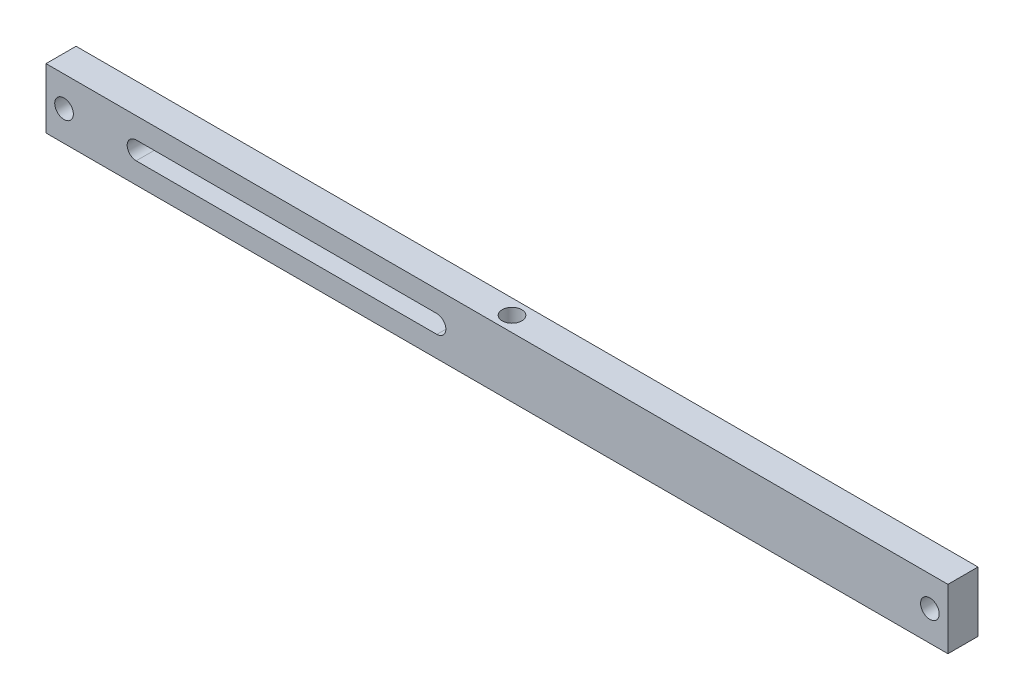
ISO-10303-21;
HEADER;
FILE_DESCRIPTION(('STEP AP214'),'2;1');
FILE_NAME('part.step','',(''),(''),'','','');
FILE_SCHEMA(('AUTOMOTIVE_DESIGN { 1 0 10303 214 1 1 1 1 }'));
ENDSEC;
DATA;
#1=APPLICATION_CONTEXT('core data for automotive mechanical design processes');
#2=APPLICATION_PROTOCOL_DEFINITION('international standard','automotive_design',2000,#1);
#3=PRODUCT_CONTEXT('',#1,'mechanical');
#4=PRODUCT('Part','Part','',(#3));
#5=PRODUCT_RELATED_PRODUCT_CATEGORY('part','',(#4));
#6=PRODUCT_DEFINITION_FORMATION('','',#4);
#7=PRODUCT_DEFINITION_CONTEXT('part definition',#1,'design');
#8=PRODUCT_DEFINITION('design','',#6,#7);
#9=PRODUCT_DEFINITION_SHAPE('','',#8);
#10=(LENGTH_UNIT() NAMED_UNIT(*) SI_UNIT(.MILLI.,.METRE.));
#11=(NAMED_UNIT(*) PLANE_ANGLE_UNIT() SI_UNIT($,.RADIAN.));
#12=(NAMED_UNIT(*) SI_UNIT($,.STERADIAN.) SOLID_ANGLE_UNIT());
#13=UNCERTAINTY_MEASURE_WITH_UNIT(LENGTH_MEASURE(1.E-05),#10,'distance_accuracy_value','');
#14=(GEOMETRIC_REPRESENTATION_CONTEXT(3) GLOBAL_UNCERTAINTY_ASSIGNED_CONTEXT((#13)) GLOBAL_UNIT_ASSIGNED_CONTEXT((#10,
#11,#12)) REPRESENTATION_CONTEXT('',''));
#15=CARTESIAN_POINT('',(0.,0.,0.));
#16=DIRECTION('',(0.,0.,1.));
#17=DIRECTION('',(1.,0.,0.));
#18=AXIS2_PLACEMENT_3D('',#15,#16,#17);
#19=CARTESIAN_POINT('',(0.,0.,5.));
#20=DIRECTION('',(0.,0.,1.));
#21=DIRECTION('',(1.,0.,0.));
#22=AXIS2_PLACEMENT_3D('',#19,#20,#21);
#23=PLANE('',#22);
#24=CARTESIAN_POINT('',(30.,10.,5.));
#25=DIRECTION('',(0.,0.,1.));
#26=DIRECTION('',(1.,0.,0.));
#27=AXIS2_PLACEMENT_3D('',#24,#25,#26);
#28=CIRCLE('',#27,3.);
#29=CARTESIAN_POINT('',(30.,13.,5.));
#30=VERTEX_POINT('',#29);
#31=CARTESIAN_POINT('',(30.,7.,5.));
#32=VERTEX_POINT('',#31);
#33=EDGE_CURVE('E52',#30,#32,#28,.T.);
#34=ORIENTED_EDGE('',*,*,#33,.F.);
#35=DIRECTION('',(-1.,0.,0.));
#36=VECTOR('',#35,1.);
#37=CARTESIAN_POINT('',(130.,13.,5.));
#38=LINE('',#37,#36);
#39=CARTESIAN_POINT('',(130.,13.,5.));
#40=VERTEX_POINT('',#39);
#41=EDGE_CURVE('E111',#40,#30,#38,.T.);
#42=ORIENTED_EDGE('',*,*,#41,.F.);
#43=CARTESIAN_POINT('',(130.,10.,5.));
#44=DIRECTION('',(0.,0.,1.));
#45=DIRECTION('',(1.,0.,0.));
#46=AXIS2_PLACEMENT_3D('',#43,#44,#45);
#47=CIRCLE('',#46,3.00000000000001);
#48=CARTESIAN_POINT('',(130.,7.,5.));
#49=VERTEX_POINT('',#48);
#50=EDGE_CURVE('E138',#49,#40,#47,.T.);
#51=ORIENTED_EDGE('',*,*,#50,.F.);
#52=DIRECTION('',(1.,0.,0.));
#53=VECTOR('',#52,1.);
#54=CARTESIAN_POINT('',(30.,7.,5.));
#55=LINE('',#54,#53);
#56=EDGE_CURVE('E130',#32,#49,#55,.T.);
#57=ORIENTED_EDGE('',*,*,#56,.F.);
#58=EDGE_LOOP('',(#34,#42,#51,#57));
#59=FACE_BOUND('',#58,.T.);
#60=CARTESIAN_POINT('',(6.,10.,5.));
#61=DIRECTION('',(0.,0.,1.));
#62=DIRECTION('',(1.,0.,0.));
#63=AXIS2_PLACEMENT_3D('',#60,#61,#62);
#64=CIRCLE('',#63,3.1);
#65=CARTESIAN_POINT('',(9.1,10.,5.));
#66=VERTEX_POINT('',#65);
#67=EDGE_CURVE('E169',#66,#66,#64,.T.);
#68=ORIENTED_EDGE('',*,*,#67,.F.);
#69=EDGE_LOOP('',(#68));
#70=FACE_BOUND('',#69,.T.);
#71=DIRECTION('',(0.,-1.,0.));
#72=VECTOR('',#71,1.);
#73=CARTESIAN_POINT('',(0.,20.,5.));
#74=LINE('',#73,#72);
#75=CARTESIAN_POINT('',(0.,20.,5.));
#76=VERTEX_POINT('',#75);
#77=CARTESIAN_POINT('',(0.,0.,5.));
#78=VERTEX_POINT('',#77);
#79=EDGE_CURVE('E186',#76,#78,#74,.T.);
#80=ORIENTED_EDGE('',*,*,#79,.T.);
#81=DIRECTION('',(1.,0.,0.));
#82=VECTOR('',#81,1.);
#83=CARTESIAN_POINT('',(0.,0.,5.));
#84=LINE('',#83,#82);
#85=CARTESIAN_POINT('',(300.,0.,5.));
#86=VERTEX_POINT('',#85);
#87=EDGE_CURVE('E190',#78,#86,#84,.T.);
#88=ORIENTED_EDGE('',*,*,#87,.T.);
#89=DIRECTION('',(0.,1.,0.));
#90=VECTOR('',#89,1.);
#91=CARTESIAN_POINT('',(300.,0.,5.));
#92=LINE('',#91,#90);
#93=CARTESIAN_POINT('',(300.,20.,5.));
#94=VERTEX_POINT('',#93);
#95=EDGE_CURVE('E193',#86,#94,#92,.T.);
#96=ORIENTED_EDGE('',*,*,#95,.T.);
#97=DIRECTION('',(-1.,0.,0.));
#98=VECTOR('',#97,1.);
#99=CARTESIAN_POINT('',(300.,20.,5.));
#100=LINE('',#99,#98);
#101=EDGE_CURVE('E196',#94,#76,#100,.T.);
#102=ORIENTED_EDGE('',*,*,#101,.T.);
#103=EDGE_LOOP('',(#80,#88,#96,#102));
#104=FACE_BOUND('',#103,.T.);
#105=CARTESIAN_POINT('',(294.,10.,5.));
#106=DIRECTION('',(0.,0.,1.));
#107=DIRECTION('',(-1.,0.,0.));
#108=AXIS2_PLACEMENT_3D('',#105,#106,#107);
#109=CIRCLE('',#108,3.09999999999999);
#110=CARTESIAN_POINT('',(290.9,10.,5.));
#111=VERTEX_POINT('',#110);
#112=EDGE_CURVE('E161',#111,#111,#109,.T.);
#113=ORIENTED_EDGE('',*,*,#112,.F.);
#114=EDGE_LOOP('',(#113));
#115=FACE_BOUND('',#114,.T.);
#116=ADVANCED_FACE('F36',(#59,#70,#104,#115),#23,.T.);
#117=CARTESIAN_POINT('',(0.,0.,-5.));
#118=DIRECTION('',(0.,0.,1.));
#119=DIRECTION('',(1.,0.,0.));
#120=AXIS2_PLACEMENT_3D('',#117,#118,#119);
#121=PLANE('',#120);
#122=DIRECTION('',(1.,0.,0.));
#123=VECTOR('',#122,1.);
#124=CARTESIAN_POINT('',(130.,13.,-5.));
#125=LINE('',#124,#123);
#126=CARTESIAN_POINT('',(30.,13.,-5.));
#127=VERTEX_POINT('',#126);
#128=CARTESIAN_POINT('',(130.,13.,-5.));
#129=VERTEX_POINT('',#128);
#130=EDGE_CURVE('E124',#127,#129,#125,.T.);
#131=ORIENTED_EDGE('',*,*,#130,.F.);
#132=CARTESIAN_POINT('',(30.,10.,-5.));
#133=DIRECTION('',(0.,0.,1.));
#134=DIRECTION('',(1.,0.,0.));
#135=AXIS2_PLACEMENT_3D('',#132,#133,#134);
#136=CIRCLE('',#135,3.);
#137=CARTESIAN_POINT('',(30.,7.,-5.));
#138=VERTEX_POINT('',#137);
#139=EDGE_CURVE('E104',#138,#127,#136,.F.);
#140=ORIENTED_EDGE('',*,*,#139,.F.);
#141=DIRECTION('',(-1.,0.,0.));
#142=VECTOR('',#141,1.);
#143=CARTESIAN_POINT('',(30.,7.,-5.));
#144=LINE('',#143,#142);
#145=CARTESIAN_POINT('',(130.,7.,-5.));
#146=VERTEX_POINT('',#145);
#147=EDGE_CURVE('E114',#146,#138,#144,.T.);
#148=ORIENTED_EDGE('',*,*,#147,.F.);
#149=CARTESIAN_POINT('',(130.,10.,-5.));
#150=DIRECTION('',(0.,0.,1.));
#151=DIRECTION('',(1.,0.,0.));
#152=AXIS2_PLACEMENT_3D('',#149,#150,#151);
#153=CIRCLE('',#152,3.00000000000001);
#154=EDGE_CURVE('E60',#129,#146,#153,.F.);
#155=ORIENTED_EDGE('',*,*,#154,.F.);
#156=EDGE_LOOP('',(#131,#140,#148,#155));
#157=FACE_BOUND('',#156,.T.);
#158=CARTESIAN_POINT('',(6.,10.,-5.));
#159=DIRECTION('',(0.,0.,1.));
#160=DIRECTION('',(1.,0.,0.));
#161=AXIS2_PLACEMENT_3D('',#158,#159,#160);
#162=CIRCLE('',#161,3.1);
#163=CARTESIAN_POINT('',(9.1,10.,-5.));
#164=VERTEX_POINT('',#163);
#165=EDGE_CURVE('E165',#164,#164,#162,.T.);
#166=ORIENTED_EDGE('',*,*,#165,.T.);
#167=EDGE_LOOP('',(#166));
#168=FACE_BOUND('',#167,.T.);
#169=DIRECTION('',(0.,-1.,0.));
#170=VECTOR('',#169,1.);
#171=CARTESIAN_POINT('',(0.,20.,-5.));
#172=LINE('',#171,#170);
#173=CARTESIAN_POINT('',(0.,20.,-5.));
#174=VERTEX_POINT('',#173);
#175=CARTESIAN_POINT('',(0.,0.,-5.));
#176=VERTEX_POINT('',#175);
#177=EDGE_CURVE('E173',#174,#176,#172,.T.);
#178=ORIENTED_EDGE('',*,*,#177,.F.);
#179=DIRECTION('',(-1.,0.,0.));
#180=VECTOR('',#179,1.);
#181=CARTESIAN_POINT('',(300.,20.,-5.));
#182=LINE('',#181,#180);
#183=CARTESIAN_POINT('',(300.,20.,-5.));
#184=VERTEX_POINT('',#183);
#185=EDGE_CURVE('E183',#184,#174,#182,.T.);
#186=ORIENTED_EDGE('',*,*,#185,.F.);
#187=DIRECTION('',(0.,1.,0.));
#188=VECTOR('',#187,1.);
#189=CARTESIAN_POINT('',(300.,0.,-5.));
#190=LINE('',#189,#188);
#191=CARTESIAN_POINT('',(300.,0.,-5.));
#192=VERTEX_POINT('',#191);
#193=EDGE_CURVE('E180',#192,#184,#190,.T.);
#194=ORIENTED_EDGE('',*,*,#193,.F.);
#195=DIRECTION('',(1.,0.,0.));
#196=VECTOR('',#195,1.);
#197=CARTESIAN_POINT('',(0.,0.,-5.));
#198=LINE('',#197,#196);
#199=EDGE_CURVE('E177',#176,#192,#198,.T.);
#200=ORIENTED_EDGE('',*,*,#199,.F.);
#201=EDGE_LOOP('',(#178,#186,#194,#200));
#202=FACE_BOUND('',#201,.T.);
#203=CARTESIAN_POINT('',(294.,10.,-5.));
#204=DIRECTION('',(0.,0.,1.));
#205=DIRECTION('',(-1.,0.,0.));
#206=AXIS2_PLACEMENT_3D('',#203,#204,#205);
#207=CIRCLE('',#206,3.09999999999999);
#208=CARTESIAN_POINT('',(290.9,10.,-5.));
#209=VERTEX_POINT('',#208);
#210=EDGE_CURVE('E158',#209,#209,#207,.T.);
#211=ORIENTED_EDGE('',*,*,#210,.T.);
#212=EDGE_LOOP('',(#211));
#213=FACE_BOUND('',#212,.T.);
#214=ADVANCED_FACE('F121',(#157,#168,#202,#213),#121,.F.);
#215=CARTESIAN_POINT('',(0.,20.,5.));
#216=DIRECTION('',(1.,0.,0.));
#217=DIRECTION('',(0.,1.,0.));
#218=AXIS2_PLACEMENT_3D('',#215,#216,#217);
#219=PLANE('',#218);
#220=ORIENTED_EDGE('',*,*,#177,.T.);
#221=DIRECTION('',(0.,0.,-1.));
#222=VECTOR('',#221,1.);
#223=CARTESIAN_POINT('',(0.,0.,5.));
#224=LINE('',#223,#222);
#225=EDGE_CURVE('E11',#78,#176,#224,.T.);
#226=ORIENTED_EDGE('',*,*,#225,.F.);
#227=ORIENTED_EDGE('',*,*,#79,.F.);
#228=DIRECTION('',(0.,0.,-1.));
#229=VECTOR('',#228,1.);
#230=CARTESIAN_POINT('',(0.,20.,5.));
#231=LINE('',#230,#229);
#232=EDGE_CURVE('E199',#76,#174,#231,.T.);
#233=ORIENTED_EDGE('',*,*,#232,.T.);
#234=EDGE_LOOP('',(#220,#226,#227,#233));
#235=FACE_BOUND('',#234,.T.);
#236=ADVANCED_FACE('F38',(#235),#219,.F.);
#237=CARTESIAN_POINT('',(0.,0.,5.));
#238=DIRECTION('',(0.,1.,0.));
#239=DIRECTION('',(0.,0.,1.));
#240=AXIS2_PLACEMENT_3D('',#237,#238,#239);
#241=PLANE('',#240);
#242=CARTESIAN_POINT('',(150.,0.,0.));
#243=DIRECTION('',(0.,1.,0.));
#244=DIRECTION('',(0.,0.,1.));
#245=AXIS2_PLACEMENT_3D('',#242,#243,#244);
#246=CIRCLE('',#245,3.25000000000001);
#247=CARTESIAN_POINT('',(150.,0.,3.25000000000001));
#248=VERTEX_POINT('',#247);
#249=EDGE_CURVE('E154',#248,#248,#246,.F.);
#250=ORIENTED_EDGE('',*,*,#249,.F.);
#251=EDGE_LOOP('',(#250));
#252=FACE_BOUND('',#251,.T.);
#253=ORIENTED_EDGE('',*,*,#199,.T.);
#254=DIRECTION('',(0.,0.,-1.));
#255=VECTOR('',#254,1.);
#256=CARTESIAN_POINT('',(300.,0.,5.));
#257=LINE('',#256,#255);
#258=EDGE_CURVE('E45',#86,#192,#257,.T.);
#259=ORIENTED_EDGE('',*,*,#258,.F.);
#260=ORIENTED_EDGE('',*,*,#87,.F.);
#261=ORIENTED_EDGE('',*,*,#225,.T.);
#262=EDGE_LOOP('',(#253,#259,#260,#261));
#263=FACE_BOUND('',#262,.T.);
#264=ADVANCED_FACE('F228',(#252,#263),#241,.F.);
#265=CARTESIAN_POINT('',(300.,0.,5.));
#266=DIRECTION('',(-1.,0.,0.));
#267=DIRECTION('',(0.,0.,1.));
#268=AXIS2_PLACEMENT_3D('',#265,#266,#267);
#269=PLANE('',#268);
#270=ORIENTED_EDGE('',*,*,#193,.T.);
#271=DIRECTION('',(0.,0.,-1.));
#272=VECTOR('',#271,1.);
#273=CARTESIAN_POINT('',(300.,20.,5.));
#274=LINE('',#273,#272);
#275=EDGE_CURVE('E203',#94,#184,#274,.T.);
#276=ORIENTED_EDGE('',*,*,#275,.F.);
#277=ORIENTED_EDGE('',*,*,#95,.F.);
#278=ORIENTED_EDGE('',*,*,#258,.T.);
#279=EDGE_LOOP('',(#270,#276,#277,#278));
#280=FACE_BOUND('',#279,.T.);
#281=ADVANCED_FACE('F212',(#280),#269,.F.);
#282=CARTESIAN_POINT('',(300.,20.,5.));
#283=DIRECTION('',(0.,-1.,0.));
#284=DIRECTION('',(0.,0.,-1.));
#285=AXIS2_PLACEMENT_3D('',#282,#283,#284);
#286=PLANE('',#285);
#287=CARTESIAN_POINT('',(150.,20.,0.));
#288=DIRECTION('',(0.,1.,0.));
#289=DIRECTION('',(0.,0.,1.));
#290=AXIS2_PLACEMENT_3D('',#287,#288,#289);
#291=CIRCLE('',#290,3.25000000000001);
#292=CARTESIAN_POINT('',(150.,20.,3.25000000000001));
#293=VERTEX_POINT('',#292);
#294=EDGE_CURVE('E118',#293,#293,#291,.T.);
#295=ORIENTED_EDGE('',*,*,#294,.F.);
#296=EDGE_LOOP('',(#295));
#297=FACE_BOUND('',#296,.T.);
#298=ORIENTED_EDGE('',*,*,#185,.T.);
#299=ORIENTED_EDGE('',*,*,#232,.F.);
#300=ORIENTED_EDGE('',*,*,#101,.F.);
#301=ORIENTED_EDGE('',*,*,#275,.T.);
#302=EDGE_LOOP('',(#298,#299,#300,#301));
#303=FACE_BOUND('',#302,.T.);
#304=ADVANCED_FACE('F221',(#297,#303),#286,.F.);
#305=CARTESIAN_POINT('',(6.,10.,5.));
#306=DIRECTION('',(0.,0.,-1.));
#307=DIRECTION('',(-1.,0.,0.));
#308=AXIS2_PLACEMENT_3D('',#305,#306,#307);
#309=CYLINDRICAL_SURFACE('',#308,3.1);
#310=ORIENTED_EDGE('',*,*,#67,.T.);
#311=EDGE_LOOP('',(#310));
#312=FACE_BOUND('',#311,.T.);
#313=ORIENTED_EDGE('',*,*,#165,.F.);
#314=EDGE_LOOP('',(#313));
#315=FACE_BOUND('',#314,.T.);
#316=ADVANCED_FACE('F248',(#312,#315),#309,.F.);
#317=CARTESIAN_POINT('',(294.,10.,5.));
#318=DIRECTION('',(0.,0.,-1.));
#319=DIRECTION('',(-1.,0.,0.));
#320=AXIS2_PLACEMENT_3D('',#317,#318,#319);
#321=CYLINDRICAL_SURFACE('',#320,3.09999999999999);
#322=ORIENTED_EDGE('',*,*,#112,.T.);
#323=EDGE_LOOP('',(#322));
#324=FACE_BOUND('',#323,.T.);
#325=ORIENTED_EDGE('',*,*,#210,.F.);
#326=EDGE_LOOP('',(#325));
#327=FACE_BOUND('',#326,.T.);
#328=ADVANCED_FACE('F253',(#324,#327),#321,.F.);
#329=CARTESIAN_POINT('',(150.,-0.001000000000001,0.));
#330=DIRECTION('',(0.,1.,0.));
#331=DIRECTION('',(0.,0.,1.));
#332=AXIS2_PLACEMENT_3D('',#329,#330,#331);
#333=CYLINDRICAL_SURFACE('',#332,3.25000000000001);
#334=ORIENTED_EDGE('',*,*,#294,.T.);
#335=EDGE_LOOP('',(#334));
#336=FACE_BOUND('',#335,.T.);
#337=ORIENTED_EDGE('',*,*,#249,.T.);
#338=EDGE_LOOP('',(#337));
#339=FACE_BOUND('',#338,.T.);
#340=ADVANCED_FACE('F257',(#336,#339),#333,.F.);
#341=CARTESIAN_POINT('',(30.,10.,-5.001));
#342=DIRECTION('',(0.,0.,1.));
#343=DIRECTION('',(1.,0.,0.));
#344=AXIS2_PLACEMENT_3D('',#341,#342,#343);
#345=CYLINDRICAL_SURFACE('',#344,3.);
#346=ORIENTED_EDGE('',*,*,#139,.T.);
#347=DIRECTION('',(0.,0.,1.));
#348=VECTOR('',#347,1.);
#349=CARTESIAN_POINT('',(30.,13.,-5.001));
#350=LINE('',#349,#348);
#351=EDGE_CURVE('E119',#127,#30,#350,.T.);
#352=ORIENTED_EDGE('',*,*,#351,.T.);
#353=ORIENTED_EDGE('',*,*,#33,.T.);
#354=DIRECTION('',(0.,0.,1.));
#355=VECTOR('',#354,1.);
#356=CARTESIAN_POINT('',(30.,7.,-5.001));
#357=LINE('',#356,#355);
#358=EDGE_CURVE('E100',#138,#32,#357,.T.);
#359=ORIENTED_EDGE('',*,*,#358,.F.);
#360=EDGE_LOOP('',(#346,#352,#353,#359));
#361=FACE_BOUND('',#360,.T.);
#362=ADVANCED_FACE('F102',(#361),#345,.F.);
#363=CARTESIAN_POINT('',(130.,13.,-5.001));
#364=DIRECTION('',(0.,1.,0.));
#365=DIRECTION('',(-1.,0.,0.));
#366=AXIS2_PLACEMENT_3D('',#363,#364,#365);
#367=PLANE('',#366);
#368=ORIENTED_EDGE('',*,*,#130,.T.);
#369=DIRECTION('',(0.,0.,1.));
#370=VECTOR('',#369,1.);
#371=CARTESIAN_POINT('',(130.,13.,-5.001));
#372=LINE('',#371,#370);
#373=EDGE_CURVE('E146',#129,#40,#372,.T.);
#374=ORIENTED_EDGE('',*,*,#373,.T.);
#375=ORIENTED_EDGE('',*,*,#41,.T.);
#376=ORIENTED_EDGE('',*,*,#351,.F.);
#377=EDGE_LOOP('',(#368,#374,#375,#376));
#378=FACE_BOUND('',#377,.T.);
#379=ADVANCED_FACE('F265',(#378),#367,.F.);
#380=CARTESIAN_POINT('',(130.,10.,-5.001));
#381=DIRECTION('',(0.,0.,1.));
#382=DIRECTION('',(1.,0.,0.));
#383=AXIS2_PLACEMENT_3D('',#380,#381,#382);
#384=CYLINDRICAL_SURFACE('',#383,3.00000000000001);
#385=ORIENTED_EDGE('',*,*,#154,.T.);
#386=DIRECTION('',(0.,0.,1.));
#387=VECTOR('',#386,1.);
#388=CARTESIAN_POINT('',(130.,7.,-5.001));
#389=LINE('',#388,#387);
#390=EDGE_CURVE('E110',#146,#49,#389,.T.);
#391=ORIENTED_EDGE('',*,*,#390,.T.);
#392=ORIENTED_EDGE('',*,*,#50,.T.);
#393=ORIENTED_EDGE('',*,*,#373,.F.);
#394=EDGE_LOOP('',(#385,#391,#392,#393));
#395=FACE_BOUND('',#394,.T.);
#396=ADVANCED_FACE('F272',(#395),#384,.F.);
#397=CARTESIAN_POINT('',(30.,7.,-5.001));
#398=DIRECTION('',(0.,-1.,0.));
#399=DIRECTION('',(0.,0.,-1.));
#400=AXIS2_PLACEMENT_3D('',#397,#398,#399);
#401=PLANE('',#400);
#402=ORIENTED_EDGE('',*,*,#147,.T.);
#403=ORIENTED_EDGE('',*,*,#358,.T.);
#404=ORIENTED_EDGE('',*,*,#56,.T.);
#405=ORIENTED_EDGE('',*,*,#390,.F.);
#406=EDGE_LOOP('',(#402,#403,#404,#405));
#407=FACE_BOUND('',#406,.T.);
#408=ADVANCED_FACE('F115',(#407),#401,.F.);
#409=CLOSED_SHELL('',(#116,#214,#236,#264,#281,#304,#316,#328,#340,#362,#379,#396,#408));
#410=MANIFOLD_SOLID_BREP('B2',#409);
#411=ADVANCED_BREP_SHAPE_REPRESENTATION('',(#18,#410),#14);
#412=SHAPE_DEFINITION_REPRESENTATION(#9,#411);
ENDSEC;
END-ISO-10303-21;
